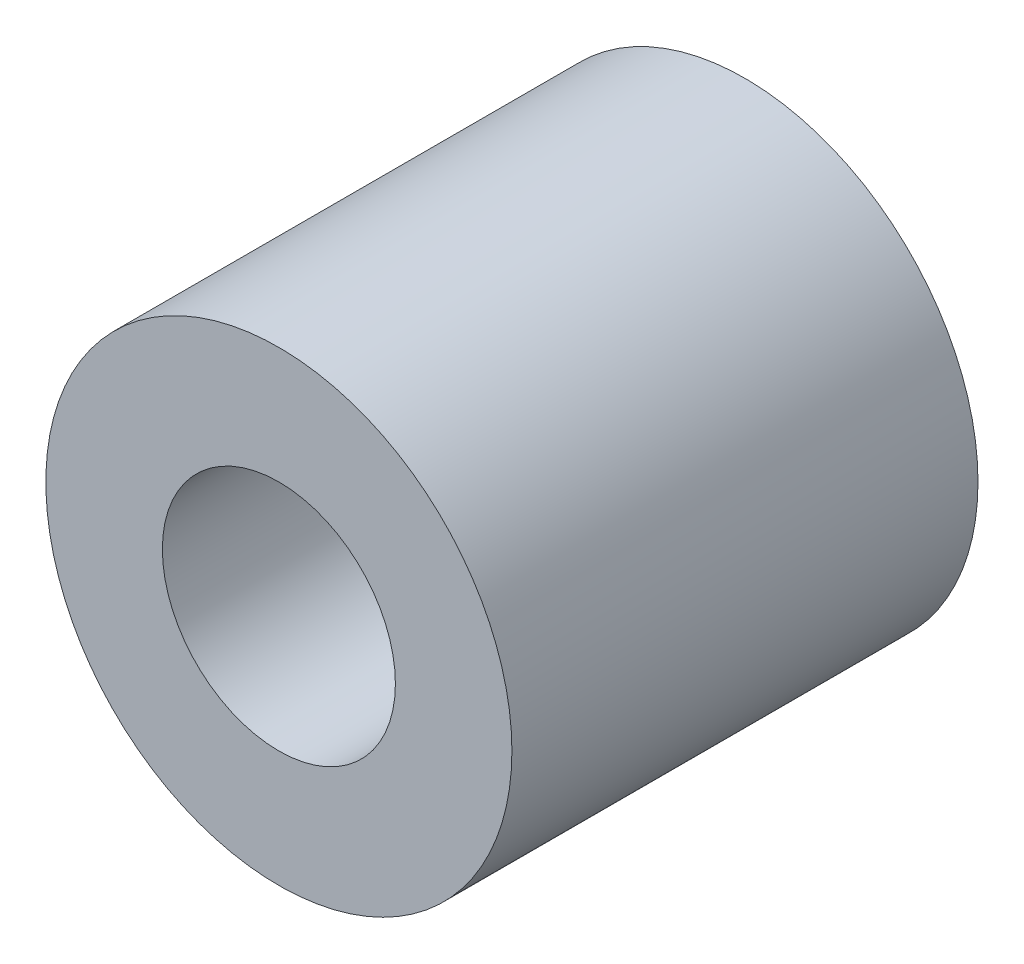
from build123d import *

# Parameters (mm, degrees)
ESQUISSE1_R             = 10
BASE_EXTRUSION_DEPTH    = 20
ESQUISSE2_R             = 5
ENL_V_MAT_EXTRU_1_DEPTH = 11
ENL_V_MAT_EXTRU_2_DEPTH = 9


with BuildPart() as part:
    # Esquisse1 → Base-Extrusion (new body)
    with BuildSketch(Plane.XY):
        Circle(ESQUISSE1_R)
    extrude(amount=-BASE_EXTRUSION_DEPTH)

    # Esquisse2 → Enl_v. mat.-Extru.1 (cut)
    with BuildSketch(Plane.XY):
        Circle(ESQUISSE2_R)
    extrude(amount=-ENL_V_MAT_EXTRU_1_DEPTH, mode=Mode.SUBTRACT)

    # Esquisse3 → Enl_v. mat.-Extru.2 (cut)
    with BuildSketch(Plane(origin=(0, 0, -20), x_dir=(-1, 0, 0), z_dir=(0, 0, -1))):
        Polygon((-6.92820323, 0), (-3.464101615, -6), (3.464101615, -6), (6.92820323, 0), (3.464101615, 6), (-3.464101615, 6), align=None)
    extrude(amount=-ENL_V_MAT_EXTRU_2_DEPTH, mode=Mode.SUBTRACT)


solid = part.part
